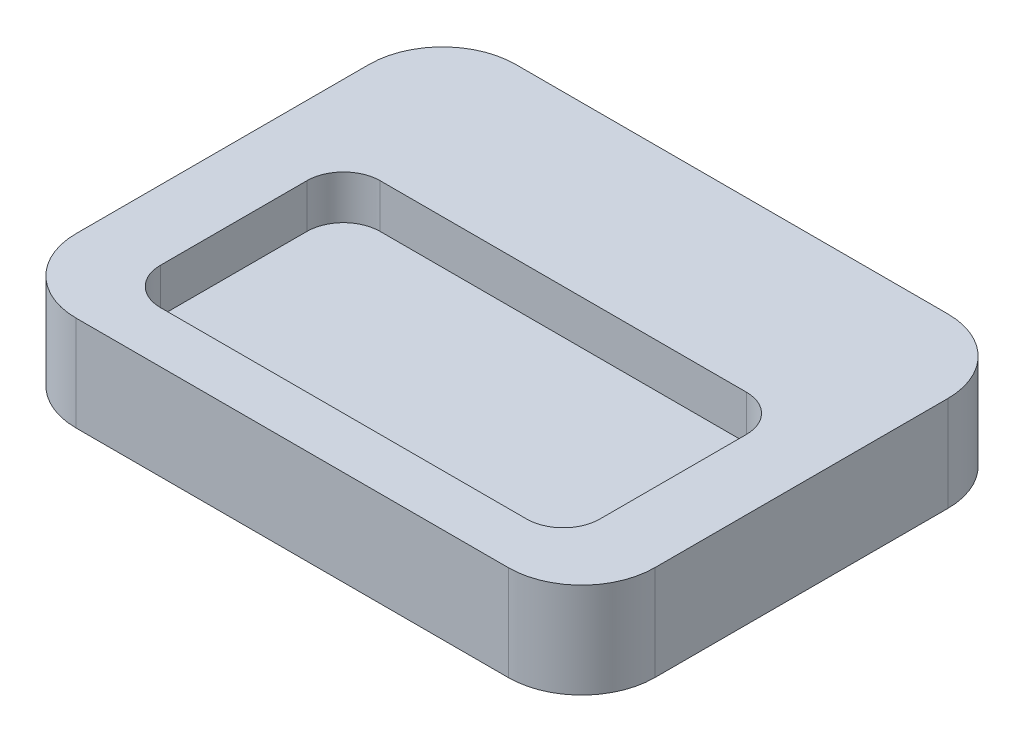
ISO-10303-21;
HEADER;
FILE_DESCRIPTION(('STEP AP214'),'2;1');
FILE_NAME('part.step','',(''),(''),'','','');
FILE_SCHEMA(('AUTOMOTIVE_DESIGN { 1 0 10303 214 1 1 1 1 }'));
ENDSEC;
DATA;
#1=APPLICATION_CONTEXT('core data for automotive mechanical design processes');
#2=APPLICATION_PROTOCOL_DEFINITION('international standard','automotive_design',2000,#1);
#3=PRODUCT_CONTEXT('',#1,'mechanical');
#4=PRODUCT('Part','Part','',(#3));
#5=PRODUCT_RELATED_PRODUCT_CATEGORY('part','',(#4));
#6=PRODUCT_DEFINITION_FORMATION('','',#4);
#7=PRODUCT_DEFINITION_CONTEXT('part definition',#1,'design');
#8=PRODUCT_DEFINITION('design','',#6,#7);
#9=PRODUCT_DEFINITION_SHAPE('','',#8);
#10=(LENGTH_UNIT() NAMED_UNIT(*) SI_UNIT(.MILLI.,.METRE.));
#11=(NAMED_UNIT(*) PLANE_ANGLE_UNIT() SI_UNIT($,.RADIAN.));
#12=(NAMED_UNIT(*) SI_UNIT($,.STERADIAN.) SOLID_ANGLE_UNIT());
#13=UNCERTAINTY_MEASURE_WITH_UNIT(LENGTH_MEASURE(1.E-05),#10,'distance_accuracy_value','');
#14=(GEOMETRIC_REPRESENTATION_CONTEXT(3) GLOBAL_UNCERTAINTY_ASSIGNED_CONTEXT((#13)) GLOBAL_UNIT_ASSIGNED_CONTEXT((#10,
#11,#12)) REPRESENTATION_CONTEXT('',''));
#15=CARTESIAN_POINT('',(0.,0.,0.));
#16=DIRECTION('',(0.,0.,1.));
#17=DIRECTION('',(1.,0.,0.));
#18=AXIS2_PLACEMENT_3D('',#15,#16,#17);
#19=CARTESIAN_POINT('',(0.,26.,-15.0580110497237));
#20=DIRECTION('',(0.,0.,-1.));
#21=DIRECTION('',(-1.,0.,0.));
#22=AXIS2_PLACEMENT_3D('',#19,#20,#21);
#23=PLANE('',#22);
#24=DIRECTION('',(0.,-1.,0.));
#25=VECTOR('',#24,1.);
#26=CARTESIAN_POINT('',(-26.3720073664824,26.,-15.0580110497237));
#27=LINE('',#26,#25);
#28=CARTESIAN_POINT('',(-26.3720073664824,13.,-15.0580110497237));
#29=VERTEX_POINT('',#28);
#30=CARTESIAN_POINT('',(-26.3720073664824,0.,-15.0580110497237));
#31=VERTEX_POINT('',#30);
#32=EDGE_CURVE('E542',#29,#31,#27,.T.);
#33=ORIENTED_EDGE('',*,*,#32,.F.);
#34=DIRECTION('',(1.,0.,0.));
#35=VECTOR('',#34,1.);
#36=CARTESIAN_POINT('',(0.,13.,-15.0580110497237));
#37=LINE('',#36,#35);
#38=CARTESIAN_POINT('',(32.6279926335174,13.,-15.0580110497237));
#39=VERTEX_POINT('',#38);
#40=EDGE_CURVE('E465',#29,#39,#37,.T.);
#41=ORIENTED_EDGE('',*,*,#40,.T.);
#42=DIRECTION('',(0.,-1.,0.));
#43=VECTOR('',#42,1.);
#44=CARTESIAN_POINT('',(32.6279926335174,26.,-15.0580110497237));
#45=LINE('',#44,#43);
#46=CARTESIAN_POINT('',(32.6279926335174,0.,-15.0580110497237));
#47=VERTEX_POINT('',#46);
#48=EDGE_CURVE('E544',#39,#47,#45,.T.);
#49=ORIENTED_EDGE('',*,*,#48,.T.);
#50=DIRECTION('',(1.,0.,0.));
#51=VECTOR('',#50,1.);
#52=CARTESIAN_POINT('',(0.,0.,-15.0580110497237));
#53=LINE('',#52,#51);
#54=EDGE_CURVE('E539',#31,#47,#53,.T.);
#55=ORIENTED_EDGE('',*,*,#54,.F.);
#56=EDGE_LOOP('',(#33,#41,#49,#55));
#57=FACE_BOUND('',#56,.T.);
#58=ADVANCED_FACE('F91',(#57),#23,.T.);
#59=CARTESIAN_POINT('',(32.6279926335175,26.,-5.0580110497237));
#60=DIRECTION('',(0.,-1.,0.));
#61=DIRECTION('',(0.,0.,-1.));
#62=AXIS2_PLACEMENT_3D('',#59,#60,#61);
#63=CYLINDRICAL_SURFACE('',#62,10.);
#64=CARTESIAN_POINT('',(32.6279926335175,13.,-5.0580110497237));
#65=DIRECTION('',(0.,1.,0.));
#66=DIRECTION('',(0.,0.,1.));
#67=AXIS2_PLACEMENT_3D('',#64,#65,#66);
#68=CIRCLE('',#67,10.);
#69=CARTESIAN_POINT('',(42.6279926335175,13.,-5.05801104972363));
#70=VERTEX_POINT('',#69);
#71=EDGE_CURVE('E463',#70,#39,#68,.T.);
#72=ORIENTED_EDGE('',*,*,#71,.F.);
#73=DIRECTION('',(0.,-1.,0.));
#74=VECTOR('',#73,1.);
#75=CARTESIAN_POINT('',(42.6279926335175,26.,-5.05801104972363));
#76=LINE('',#75,#74);
#77=CARTESIAN_POINT('',(42.6279926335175,0.,-5.05801104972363));
#78=VERTEX_POINT('',#77);
#79=EDGE_CURVE('E546',#70,#78,#76,.T.);
#80=ORIENTED_EDGE('',*,*,#79,.T.);
#81=CARTESIAN_POINT('',(32.6279926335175,0.,-5.0580110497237));
#82=DIRECTION('',(0.,1.,0.));
#83=DIRECTION('',(0.,0.,1.));
#84=AXIS2_PLACEMENT_3D('',#81,#82,#83);
#85=CIRCLE('',#84,10.);
#86=EDGE_CURVE('E536',#78,#47,#85,.T.);
#87=ORIENTED_EDGE('',*,*,#86,.T.);
#88=ORIENTED_EDGE('',*,*,#48,.F.);
#89=EDGE_LOOP('',(#72,#80,#87,#88));
#90=FACE_BOUND('',#89,.T.);
#91=ADVANCED_FACE('F586',(#90),#63,.T.);
#92=CARTESIAN_POINT('',(42.6279926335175,26.,0.));
#93=DIRECTION('',(1.,0.,0.));
#94=DIRECTION('',(0.,0.,-1.));
#95=AXIS2_PLACEMENT_3D('',#92,#93,#94);
#96=PLANE('',#95);
#97=ORIENTED_EDGE('',*,*,#79,.F.);
#98=DIRECTION('',(0.,0.,1.));
#99=VECTOR('',#98,1.);
#100=CARTESIAN_POINT('',(42.6279926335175,13.,0.));
#101=LINE('',#100,#99);
#102=CARTESIAN_POINT('',(42.6279926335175,13.,34.9419889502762));
#103=VERTEX_POINT('',#102);
#104=EDGE_CURVE('E460',#70,#103,#101,.T.);
#105=ORIENTED_EDGE('',*,*,#104,.T.);
#106=DIRECTION('',(0.,-1.,0.));
#107=VECTOR('',#106,1.);
#108=CARTESIAN_POINT('',(42.6279926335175,26.,34.9419889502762));
#109=LINE('',#108,#107);
#110=CARTESIAN_POINT('',(42.6279926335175,0.,34.9419889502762));
#111=VERTEX_POINT('',#110);
#112=EDGE_CURVE('E548',#103,#111,#109,.T.);
#113=ORIENTED_EDGE('',*,*,#112,.T.);
#114=DIRECTION('',(0.,0.,1.));
#115=VECTOR('',#114,1.);
#116=CARTESIAN_POINT('',(42.6279926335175,0.,0.));
#117=LINE('',#116,#115);
#118=EDGE_CURVE('E533',#78,#111,#117,.T.);
#119=ORIENTED_EDGE('',*,*,#118,.F.);
#120=EDGE_LOOP('',(#97,#105,#113,#119));
#121=FACE_BOUND('',#120,.T.);
#122=ADVANCED_FACE('F582',(#121),#96,.T.);
#123=CARTESIAN_POINT('',(32.6279926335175,26.,34.9419889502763));
#124=DIRECTION('',(0.,-1.,0.));
#125=DIRECTION('',(0.,0.,-1.));
#126=AXIS2_PLACEMENT_3D('',#123,#124,#125);
#127=CYLINDRICAL_SURFACE('',#126,10.);
#128=CARTESIAN_POINT('',(32.6279926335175,13.,34.9419889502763));
#129=DIRECTION('',(0.,1.,0.));
#130=DIRECTION('',(0.,0.,1.));
#131=AXIS2_PLACEMENT_3D('',#128,#129,#130);
#132=CIRCLE('',#131,10.);
#133=CARTESIAN_POINT('',(32.6279926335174,13.,44.9419889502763));
#134=VERTEX_POINT('',#133);
#135=EDGE_CURVE('E458',#134,#103,#132,.T.);
#136=ORIENTED_EDGE('',*,*,#135,.F.);
#137=DIRECTION('',(0.,-1.,0.));
#138=VECTOR('',#137,1.);
#139=CARTESIAN_POINT('',(32.6279926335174,26.,44.9419889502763));
#140=LINE('',#139,#138);
#141=CARTESIAN_POINT('',(32.6279926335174,0.,44.9419889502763));
#142=VERTEX_POINT('',#141);
#143=EDGE_CURVE('E550',#134,#142,#140,.T.);
#144=ORIENTED_EDGE('',*,*,#143,.T.);
#145=CARTESIAN_POINT('',(32.6279926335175,0.,34.9419889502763));
#146=DIRECTION('',(0.,1.,0.));
#147=DIRECTION('',(0.,0.,1.));
#148=AXIS2_PLACEMENT_3D('',#145,#146,#147);
#149=CIRCLE('',#148,10.);
#150=EDGE_CURVE('E530',#142,#111,#149,.T.);
#151=ORIENTED_EDGE('',*,*,#150,.T.);
#152=ORIENTED_EDGE('',*,*,#112,.F.);
#153=EDGE_LOOP('',(#136,#144,#151,#152));
#154=FACE_BOUND('',#153,.T.);
#155=ADVANCED_FACE('F578',(#154),#127,.T.);
#156=CARTESIAN_POINT('',(0.,26.,44.9419889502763));
#157=DIRECTION('',(0.,0.,-1.));
#158=DIRECTION('',(-1.,0.,0.));
#159=AXIS2_PLACEMENT_3D('',#156,#157,#158);
#160=PLANE('',#159);
#161=DIRECTION('',(1.,0.,0.));
#162=VECTOR('',#161,1.);
#163=CARTESIAN_POINT('',(0.,13.,44.9419889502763));
#164=LINE('',#163,#162);
#165=CARTESIAN_POINT('',(-26.3720073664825,13.,44.9419889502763));
#166=VERTEX_POINT('',#165);
#167=EDGE_CURVE('E456',#166,#134,#164,.T.);
#168=ORIENTED_EDGE('',*,*,#167,.F.);
#169=DIRECTION('',(0.,-1.,0.));
#170=VECTOR('',#169,1.);
#171=CARTESIAN_POINT('',(-26.3720073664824,26.,44.9419889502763));
#172=LINE('',#171,#170);
#173=CARTESIAN_POINT('',(-26.3720073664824,0.,44.9419889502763));
#174=VERTEX_POINT('',#173);
#175=EDGE_CURVE('E552',#166,#174,#172,.T.);
#176=ORIENTED_EDGE('',*,*,#175,.T.);
#177=DIRECTION('',(1.,0.,0.));
#178=VECTOR('',#177,1.);
#179=CARTESIAN_POINT('',(0.,0.,44.9419889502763));
#180=LINE('',#179,#178);
#181=EDGE_CURVE('E527',#174,#142,#180,.T.);
#182=ORIENTED_EDGE('',*,*,#181,.T.);
#183=ORIENTED_EDGE('',*,*,#143,.F.);
#184=EDGE_LOOP('',(#168,#176,#182,#183));
#185=FACE_BOUND('',#184,.T.);
#186=ADVANCED_FACE('F572',(#185),#160,.F.);
#187=CARTESIAN_POINT('',(-26.3720073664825,26.,34.9419889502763));
#188=DIRECTION('',(0.,-1.,0.));
#189=DIRECTION('',(0.,0.,-1.));
#190=AXIS2_PLACEMENT_3D('',#187,#188,#189);
#191=CYLINDRICAL_SURFACE('',#190,10.);
#192=CARTESIAN_POINT('',(-26.3720073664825,13.,34.9419889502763));
#193=DIRECTION('',(0.,1.,0.));
#194=DIRECTION('',(0.,0.,1.));
#195=AXIS2_PLACEMENT_3D('',#192,#193,#194);
#196=CIRCLE('',#195,10.);
#197=CARTESIAN_POINT('',(-36.3720073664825,13.,34.9419889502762));
#198=VERTEX_POINT('',#197);
#199=EDGE_CURVE('E454',#198,#166,#196,.T.);
#200=ORIENTED_EDGE('',*,*,#199,.F.);
#201=DIRECTION('',(0.,-1.,0.));
#202=VECTOR('',#201,1.);
#203=CARTESIAN_POINT('',(-36.3720073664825,26.,34.9419889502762));
#204=LINE('',#203,#202);
#205=CARTESIAN_POINT('',(-36.3720073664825,0.,34.9419889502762));
#206=VERTEX_POINT('',#205);
#207=EDGE_CURVE('E99',#198,#206,#204,.T.);
#208=ORIENTED_EDGE('',*,*,#207,.T.);
#209=CARTESIAN_POINT('',(-26.3720073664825,0.,34.9419889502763));
#210=DIRECTION('',(0.,1.,0.));
#211=DIRECTION('',(0.,0.,1.));
#212=AXIS2_PLACEMENT_3D('',#209,#210,#211);
#213=CIRCLE('',#212,10.);
#214=EDGE_CURVE('E524',#206,#174,#213,.T.);
#215=ORIENTED_EDGE('',*,*,#214,.T.);
#216=ORIENTED_EDGE('',*,*,#175,.F.);
#217=EDGE_LOOP('',(#200,#208,#215,#216));
#218=FACE_BOUND('',#217,.T.);
#219=ADVANCED_FACE('F556',(#218),#191,.T.);
#220=CARTESIAN_POINT('',(-36.3720073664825,26.,0.));
#221=DIRECTION('',(1.,0.,0.));
#222=DIRECTION('',(0.,0.,-1.));
#223=AXIS2_PLACEMENT_3D('',#220,#221,#222);
#224=PLANE('',#223);
#225=DIRECTION('',(0.,0.,1.));
#226=VECTOR('',#225,1.);
#227=CARTESIAN_POINT('',(-36.3720073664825,13.,0.));
#228=LINE('',#227,#226);
#229=CARTESIAN_POINT('',(-36.3720073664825,13.,-5.05801104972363));
#230=VERTEX_POINT('',#229);
#231=EDGE_CURVE('E452',#230,#198,#228,.T.);
#232=ORIENTED_EDGE('',*,*,#231,.F.);
#233=DIRECTION('',(0.,-1.,0.));
#234=VECTOR('',#233,1.);
#235=CARTESIAN_POINT('',(-36.3720073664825,26.,-5.05801104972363));
#236=LINE('',#235,#234);
#237=CARTESIAN_POINT('',(-36.3720073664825,0.,-5.05801104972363));
#238=VERTEX_POINT('',#237);
#239=EDGE_CURVE('E12',#230,#238,#236,.T.);
#240=ORIENTED_EDGE('',*,*,#239,.T.);
#241=DIRECTION('',(0.,0.,1.));
#242=VECTOR('',#241,1.);
#243=CARTESIAN_POINT('',(-36.3720073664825,0.,0.));
#244=LINE('',#243,#242);
#245=EDGE_CURVE('E521',#238,#206,#244,.T.);
#246=ORIENTED_EDGE('',*,*,#245,.T.);
#247=ORIENTED_EDGE('',*,*,#207,.F.);
#248=EDGE_LOOP('',(#232,#240,#246,#247));
#249=FACE_BOUND('',#248,.T.);
#250=ADVANCED_FACE('F563',(#249),#224,.F.);
#251=CARTESIAN_POINT('',(-26.3720073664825,26.,-5.0580110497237));
#252=DIRECTION('',(0.,-1.,0.));
#253=DIRECTION('',(0.,0.,-1.));
#254=AXIS2_PLACEMENT_3D('',#251,#252,#253);
#255=CYLINDRICAL_SURFACE('',#254,10.);
#256=ORIENTED_EDGE('',*,*,#239,.F.);
#257=CARTESIAN_POINT('',(-26.3720073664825,13.,-5.0580110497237));
#258=DIRECTION('',(0.,1.,0.));
#259=DIRECTION('',(0.,0.,1.));
#260=AXIS2_PLACEMENT_3D('',#257,#258,#259);
#261=CIRCLE('',#260,10.);
#262=EDGE_CURVE('E449',#230,#29,#261,.F.);
#263=ORIENTED_EDGE('',*,*,#262,.T.);
#264=ORIENTED_EDGE('',*,*,#32,.T.);
#265=CARTESIAN_POINT('',(-26.3720073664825,0.,-5.0580110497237));
#266=DIRECTION('',(0.,1.,0.));
#267=DIRECTION('',(0.,0.,1.));
#268=AXIS2_PLACEMENT_3D('',#265,#266,#267);
#269=CIRCLE('',#268,10.);
#270=EDGE_CURVE('E498',#238,#31,#269,.F.);
#271=ORIENTED_EDGE('',*,*,#270,.F.);
#272=EDGE_LOOP('',(#256,#263,#264,#271));
#273=FACE_BOUND('',#272,.T.);
#274=ADVANCED_FACE('F93',(#273),#255,.T.);
#275=CARTESIAN_POINT('',(0.,0.,0.));
#276=DIRECTION('',(0.,1.,0.));
#277=DIRECTION('',(0.,0.,1.));
#278=AXIS2_PLACEMENT_3D('',#275,#276,#277);
#279=PLANE('',#278);
#280=DIRECTION('',(-1.,0.,0.));
#281=VECTOR('',#280,1.);
#282=CARTESIAN_POINT('',(0.127992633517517,0.,39.9419889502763));
#283=LINE('',#282,#281);
#284=CARTESIAN_POINT('',(6.12799263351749,0.,39.9419889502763));
#285=VERTEX_POINT('',#284);
#286=CARTESIAN_POINT('',(0.127992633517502,0.,39.9419889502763));
#287=VERTEX_POINT('',#286);
#288=EDGE_CURVE('E340',#285,#287,#283,.T.);
#289=ORIENTED_EDGE('',*,*,#288,.F.);
#290=CARTESIAN_POINT('',(6.1279926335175,0.,37.9419889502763));
#291=DIRECTION('',(0.,-1.,0.));
#292=DIRECTION('',(0.,0.,-1.));
#293=AXIS2_PLACEMENT_3D('',#290,#291,#292);
#294=CIRCLE('',#293,2.);
#295=CARTESIAN_POINT('',(8.1279926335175,0.,37.9419889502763));
#296=VERTEX_POINT('',#295);
#297=EDGE_CURVE('E106',#296,#285,#294,.T.);
#298=ORIENTED_EDGE('',*,*,#297,.F.);
#299=DIRECTION('',(0.,0.,1.));
#300=VECTOR('',#299,1.);
#301=CARTESIAN_POINT('',(8.1279926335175,0.,31.9419889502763));
#302=LINE('',#301,#300);
#303=CARTESIAN_POINT('',(8.1279926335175,0.,31.9419889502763));
#304=VERTEX_POINT('',#303);
#305=EDGE_CURVE('E320',#304,#296,#302,.T.);
#306=ORIENTED_EDGE('',*,*,#305,.F.);
#307=CARTESIAN_POINT('',(6.1279926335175,0.,31.9419889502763));
#308=DIRECTION('',(0.,-1.,0.));
#309=DIRECTION('',(0.,0.,-1.));
#310=AXIS2_PLACEMENT_3D('',#307,#308,#309);
#311=CIRCLE('',#310,2.);
#312=CARTESIAN_POINT('',(6.12799263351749,0.,29.9419889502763));
#313=VERTEX_POINT('',#312);
#314=EDGE_CURVE('E323',#313,#304,#311,.T.);
#315=ORIENTED_EDGE('',*,*,#314,.F.);
#316=DIRECTION('',(1.,0.,0.));
#317=VECTOR('',#316,1.);
#318=CARTESIAN_POINT('',(0.127992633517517,0.,29.9419889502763));
#319=LINE('',#318,#317);
#320=CARTESIAN_POINT('',(0.127992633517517,0.,29.9419889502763));
#321=VERTEX_POINT('',#320);
#322=EDGE_CURVE('E351',#321,#313,#319,.T.);
#323=ORIENTED_EDGE('',*,*,#322,.F.);
#324=CARTESIAN_POINT('',(0.127992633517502,0.,31.9419889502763));
#325=DIRECTION('',(0.,-1.,0.));
#326=DIRECTION('',(0.,0.,-1.));
#327=AXIS2_PLACEMENT_3D('',#324,#325,#326);
#328=CIRCLE('',#327,2.);
#329=CARTESIAN_POINT('',(-1.8720073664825,0.,31.9419889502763));
#330=VERTEX_POINT('',#329);
#331=EDGE_CURVE('E348',#330,#321,#328,.T.);
#332=ORIENTED_EDGE('',*,*,#331,.F.);
#333=DIRECTION('',(0.,0.,-1.));
#334=VECTOR('',#333,1.);
#335=CARTESIAN_POINT('',(-1.8720073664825,0.,31.9419889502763));
#336=LINE('',#335,#334);
#337=CARTESIAN_POINT('',(-1.8720073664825,0.,37.9419889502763));
#338=VERTEX_POINT('',#337);
#339=EDGE_CURVE('E345',#338,#330,#336,.T.);
#340=ORIENTED_EDGE('',*,*,#339,.F.);
#341=CARTESIAN_POINT('',(0.127992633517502,0.,37.9419889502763));
#342=DIRECTION('',(0.,-1.,0.));
#343=DIRECTION('',(0.,0.,1.));
#344=AXIS2_PLACEMENT_3D('',#341,#342,#343);
#345=CIRCLE('',#344,2.);
#346=EDGE_CURVE('E342',#287,#338,#345,.T.);
#347=ORIENTED_EDGE('',*,*,#346,.F.);
#348=EDGE_LOOP('',(#289,#298,#306,#315,#323,#332,#340,#347));
#349=FACE_BOUND('',#348,.T.);
#350=DIRECTION('',(0.,0.,1.));
#351=VECTOR('',#350,1.);
#352=CARTESIAN_POINT('',(30.1279926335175,0.,-6.3080110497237));
#353=LINE('',#352,#351);
#354=CARTESIAN_POINT('',(30.1279926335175,0.,-6.3080110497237));
#355=VERTEX_POINT('',#354);
#356=CARTESIAN_POINT('',(30.1279926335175,0.,16.1919889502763));
#357=VERTEX_POINT('',#356);
#358=EDGE_CURVE('E396',#355,#357,#353,.T.);
#359=ORIENTED_EDGE('',*,*,#358,.F.);
#360=CARTESIAN_POINT('',(28.1279926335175,0.,-6.3080110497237));
#361=DIRECTION('',(0.,-1.,0.));
#362=DIRECTION('',(0.,0.,1.));
#363=AXIS2_PLACEMENT_3D('',#360,#361,#362);
#364=CIRCLE('',#363,2.);
#365=CARTESIAN_POINT('',(28.1279926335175,0.,-8.3080110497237));
#366=VERTEX_POINT('',#365);
#367=EDGE_CURVE('E114',#366,#355,#364,.T.);
#368=ORIENTED_EDGE('',*,*,#367,.F.);
#369=DIRECTION('',(1.,0.,0.));
#370=VECTOR('',#369,1.);
#371=CARTESIAN_POINT('',(-21.8720073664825,0.,-8.3080110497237));
#372=LINE('',#371,#370);
#373=CARTESIAN_POINT('',(-21.8720073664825,0.,-8.30801104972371));
#374=VERTEX_POINT('',#373);
#375=EDGE_CURVE('E373',#374,#366,#372,.T.);
#376=ORIENTED_EDGE('',*,*,#375,.F.);
#377=CARTESIAN_POINT('',(-21.8720073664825,0.,-6.3080110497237));
#378=DIRECTION('',(0.,-1.,0.));
#379=DIRECTION('',(0.,0.,1.));
#380=AXIS2_PLACEMENT_3D('',#377,#378,#379);
#381=CIRCLE('',#380,2.);
#382=CARTESIAN_POINT('',(-23.8720073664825,0.,-6.3080110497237));
#383=VERTEX_POINT('',#382);
#384=EDGE_CURVE('E411',#383,#374,#381,.T.);
#385=ORIENTED_EDGE('',*,*,#384,.F.);
#386=DIRECTION('',(0.,0.,-1.));
#387=VECTOR('',#386,1.);
#388=CARTESIAN_POINT('',(-23.8720073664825,0.,-6.3080110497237));
#389=LINE('',#388,#387);
#390=CARTESIAN_POINT('',(-23.8720073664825,0.,16.1919889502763));
#391=VERTEX_POINT('',#390);
#392=EDGE_CURVE('E408',#391,#383,#389,.T.);
#393=ORIENTED_EDGE('',*,*,#392,.F.);
#394=CARTESIAN_POINT('',(-21.8720073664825,0.,16.1919889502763));
#395=DIRECTION('',(0.,-1.,0.));
#396=DIRECTION('',(0.,0.,-1.));
#397=AXIS2_PLACEMENT_3D('',#394,#395,#396);
#398=CIRCLE('',#397,2.);
#399=CARTESIAN_POINT('',(-21.8720073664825,0.,18.1919889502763));
#400=VERTEX_POINT('',#399);
#401=EDGE_CURVE('E405',#400,#391,#398,.T.);
#402=ORIENTED_EDGE('',*,*,#401,.F.);
#403=DIRECTION('',(-1.,0.,0.));
#404=VECTOR('',#403,1.);
#405=CARTESIAN_POINT('',(-21.8720073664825,0.,18.1919889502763));
#406=LINE('',#405,#404);
#407=CARTESIAN_POINT('',(28.1279926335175,0.,18.1919889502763));
#408=VERTEX_POINT('',#407);
#409=EDGE_CURVE('E402',#408,#400,#406,.T.);
#410=ORIENTED_EDGE('',*,*,#409,.F.);
#411=CARTESIAN_POINT('',(28.1279926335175,0.,16.1919889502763));
#412=DIRECTION('',(0.,-1.,0.));
#413=DIRECTION('',(0.,0.,1.));
#414=AXIS2_PLACEMENT_3D('',#411,#412,#413);
#415=CIRCLE('',#414,2.);
#416=EDGE_CURVE('E399',#357,#408,#415,.T.);
#417=ORIENTED_EDGE('',*,*,#416,.F.);
#418=EDGE_LOOP('',(#359,#368,#376,#385,#393,#402,#410,#417));
#419=FACE_BOUND('',#418,.T.);
#420=ORIENTED_EDGE('',*,*,#270,.T.);
#421=ORIENTED_EDGE('',*,*,#54,.T.);
#422=ORIENTED_EDGE('',*,*,#86,.F.);
#423=ORIENTED_EDGE('',*,*,#118,.T.);
#424=ORIENTED_EDGE('',*,*,#150,.F.);
#425=ORIENTED_EDGE('',*,*,#181,.F.);
#426=ORIENTED_EDGE('',*,*,#214,.F.);
#427=ORIENTED_EDGE('',*,*,#245,.F.);
#428=EDGE_LOOP('',(#420,#421,#422,#423,#424,#425,#426,#427));
#429=FACE_BOUND('',#428,.T.);
#430=ADVANCED_FACE('F567',(#349,#419,#429),#279,.F.);
#431=CARTESIAN_POINT('',(0.,7.,0.));
#432=DIRECTION('',(0.,1.,0.));
#433=DIRECTION('',(0.,0.,1.));
#434=AXIS2_PLACEMENT_3D('',#431,#432,#433);
#435=PLANE('',#434);
#436=DIRECTION('',(-1.,0.,0.));
#437=VECTOR('',#436,1.);
#438=CARTESIAN_POINT('',(0.,7.,37.9419889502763));
#439=LINE('',#438,#437);
#440=CARTESIAN_POINT('',(28.1279926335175,7.,37.9419889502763));
#441=VERTEX_POINT('',#440);
#442=CARTESIAN_POINT('',(-21.8720073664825,7.,37.9419889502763));
#443=VERTEX_POINT('',#442);
#444=EDGE_CURVE('E468',#441,#443,#439,.T.);
#445=ORIENTED_EDGE('',*,*,#444,.F.);
#446=CARTESIAN_POINT('',(28.1279926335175,7.,32.9419889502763));
#447=DIRECTION('',(0.,1.,0.));
#448=DIRECTION('',(0.,0.,1.));
#449=AXIS2_PLACEMENT_3D('',#446,#447,#448);
#450=CIRCLE('',#449,5.);
#451=CARTESIAN_POINT('',(33.1279926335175,7.,32.9419889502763));
#452=VERTEX_POINT('',#451);
#453=EDGE_CURVE('E471',#441,#452,#450,.T.);
#454=ORIENTED_EDGE('',*,*,#453,.T.);
#455=DIRECTION('',(0.,0.,-1.));
#456=VECTOR('',#455,1.);
#457=CARTESIAN_POINT('',(33.1279926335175,7.,0.));
#458=LINE('',#457,#456);
#459=CARTESIAN_POINT('',(33.1279926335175,7.,12.9419889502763));
#460=VERTEX_POINT('',#459);
#461=EDGE_CURVE('E474',#452,#460,#458,.T.);
#462=ORIENTED_EDGE('',*,*,#461,.T.);
#463=CARTESIAN_POINT('',(28.1279926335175,7.,12.9419889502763));
#464=DIRECTION('',(0.,1.,0.));
#465=DIRECTION('',(0.,0.,1.));
#466=AXIS2_PLACEMENT_3D('',#463,#464,#465);
#467=CIRCLE('',#466,5.);
#468=CARTESIAN_POINT('',(28.1279926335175,7.,7.9419889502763));
#469=VERTEX_POINT('',#468);
#470=EDGE_CURVE('E477',#460,#469,#467,.T.);
#471=ORIENTED_EDGE('',*,*,#470,.T.);
#472=DIRECTION('',(-1.,0.,0.));
#473=VECTOR('',#472,1.);
#474=CARTESIAN_POINT('',(0.,7.,7.9419889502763));
#475=LINE('',#474,#473);
#476=CARTESIAN_POINT('',(-21.8720073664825,7.,7.94198895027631));
#477=VERTEX_POINT('',#476);
#478=EDGE_CURVE('E480',#469,#477,#475,.T.);
#479=ORIENTED_EDGE('',*,*,#478,.T.);
#480=CARTESIAN_POINT('',(-21.8720073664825,7.,12.9419889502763));
#481=DIRECTION('',(0.,1.,0.));
#482=DIRECTION('',(0.,0.,1.));
#483=AXIS2_PLACEMENT_3D('',#480,#481,#482);
#484=CIRCLE('',#483,5.);
#485=CARTESIAN_POINT('',(-26.8720073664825,7.,12.9419889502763));
#486=VERTEX_POINT('',#485);
#487=EDGE_CURVE('E483',#486,#477,#484,.F.);
#488=ORIENTED_EDGE('',*,*,#487,.F.);
#489=DIRECTION('',(0.,0.,-1.));
#490=VECTOR('',#489,1.);
#491=CARTESIAN_POINT('',(-26.8720073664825,7.,0.));
#492=LINE('',#491,#490);
#493=CARTESIAN_POINT('',(-26.8720073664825,7.,32.9419889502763));
#494=VERTEX_POINT('',#493);
#495=EDGE_CURVE('E486',#494,#486,#492,.T.);
#496=ORIENTED_EDGE('',*,*,#495,.F.);
#497=CARTESIAN_POINT('',(-21.8720073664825,7.,32.9419889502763));
#498=DIRECTION('',(0.,1.,0.));
#499=DIRECTION('',(0.,0.,1.));
#500=AXIS2_PLACEMENT_3D('',#497,#498,#499);
#501=CIRCLE('',#500,5.);
#502=EDGE_CURVE('E489',#443,#494,#501,.F.);
#503=ORIENTED_EDGE('',*,*,#502,.F.);
#504=EDGE_LOOP('',(#445,#454,#462,#471,#479,#488,#496,#503));
#505=FACE_BOUND('',#504,.T.);
#506=ADVANCED_FACE('F597',(#505),#435,.T.);
#507=CARTESIAN_POINT('',(0.,13.,0.));
#508=DIRECTION('',(0.,1.,0.));
#509=DIRECTION('',(0.,0.,1.));
#510=AXIS2_PLACEMENT_3D('',#507,#508,#509);
#511=PLANE('',#510);
#512=DIRECTION('',(-1.,0.,0.));
#513=VECTOR('',#512,1.);
#514=CARTESIAN_POINT('',(0.,13.,7.9419889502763));
#515=LINE('',#514,#513);
#516=CARTESIAN_POINT('',(28.1279926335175,13.,7.9419889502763));
#517=VERTEX_POINT('',#516);
#518=CARTESIAN_POINT('',(-21.8720073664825,13.,7.94198895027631));
#519=VERTEX_POINT('',#518);
#520=EDGE_CURVE('E492',#517,#519,#515,.T.);
#521=ORIENTED_EDGE('',*,*,#520,.F.);
#522=CARTESIAN_POINT('',(28.1279926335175,13.,12.9419889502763));
#523=DIRECTION('',(0.,1.,0.));
#524=DIRECTION('',(0.,0.,1.));
#525=AXIS2_PLACEMENT_3D('',#522,#523,#524);
#526=CIRCLE('',#525,5.);
#527=CARTESIAN_POINT('',(33.1279926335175,13.,12.9419889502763));
#528=VERTEX_POINT('',#527);
#529=EDGE_CURVE('E435',#517,#528,#526,.F.);
#530=ORIENTED_EDGE('',*,*,#529,.T.);
#531=DIRECTION('',(0.,0.,1.));
#532=VECTOR('',#531,1.);
#533=CARTESIAN_POINT('',(33.1279926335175,13.,0.));
#534=LINE('',#533,#532);
#535=CARTESIAN_POINT('',(33.1279926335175,13.,32.9419889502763));
#536=VERTEX_POINT('',#535);
#537=EDGE_CURVE('E433',#528,#536,#534,.T.);
#538=ORIENTED_EDGE('',*,*,#537,.T.);
#539=CARTESIAN_POINT('',(28.1279926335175,13.,32.9419889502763));
#540=DIRECTION('',(0.,1.,0.));
#541=DIRECTION('',(0.,0.,1.));
#542=AXIS2_PLACEMENT_3D('',#539,#540,#541);
#543=CIRCLE('',#542,5.);
#544=CARTESIAN_POINT('',(28.1279926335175,13.,37.9419889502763));
#545=VERTEX_POINT('',#544);
#546=EDGE_CURVE('E418',#536,#545,#543,.F.);
#547=ORIENTED_EDGE('',*,*,#546,.T.);
#548=DIRECTION('',(1.,0.,0.));
#549=VECTOR('',#548,1.);
#550=CARTESIAN_POINT('',(0.,13.,37.9419889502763));
#551=LINE('',#550,#549);
#552=CARTESIAN_POINT('',(-21.8720073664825,13.,37.9419889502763));
#553=VERTEX_POINT('',#552);
#554=EDGE_CURVE('E437',#553,#545,#551,.T.);
#555=ORIENTED_EDGE('',*,*,#554,.F.);
#556=CARTESIAN_POINT('',(-21.8720073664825,13.,32.9419889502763));
#557=DIRECTION('',(0.,1.,0.));
#558=DIRECTION('',(0.,0.,1.));
#559=AXIS2_PLACEMENT_3D('',#556,#557,#558);
#560=CIRCLE('',#559,5.);
#561=CARTESIAN_POINT('',(-26.8720073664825,13.,32.9419889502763));
#562=VERTEX_POINT('',#561);
#563=EDGE_CURVE('E440',#562,#553,#560,.T.);
#564=ORIENTED_EDGE('',*,*,#563,.F.);
#565=DIRECTION('',(0.,0.,1.));
#566=VECTOR('',#565,1.);
#567=CARTESIAN_POINT('',(-26.8720073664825,13.,0.));
#568=LINE('',#567,#566);
#569=CARTESIAN_POINT('',(-26.8720073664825,13.,12.9419889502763));
#570=VERTEX_POINT('',#569);
#571=EDGE_CURVE('E443',#570,#562,#568,.T.);
#572=ORIENTED_EDGE('',*,*,#571,.F.);
#573=CARTESIAN_POINT('',(-21.8720073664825,13.,12.9419889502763));
#574=DIRECTION('',(0.,1.,0.));
#575=DIRECTION('',(0.,0.,1.));
#576=AXIS2_PLACEMENT_3D('',#573,#574,#575);
#577=CIRCLE('',#576,5.);
#578=EDGE_CURVE('E446',#519,#570,#577,.T.);
#579=ORIENTED_EDGE('',*,*,#578,.F.);
#580=EDGE_LOOP('',(#521,#530,#538,#547,#555,#564,#572,#579));
#581=FACE_BOUND('',#580,.T.);
#582=ORIENTED_EDGE('',*,*,#262,.F.);
#583=ORIENTED_EDGE('',*,*,#231,.T.);
#584=ORIENTED_EDGE('',*,*,#199,.T.);
#585=ORIENTED_EDGE('',*,*,#167,.T.);
#586=ORIENTED_EDGE('',*,*,#135,.T.);
#587=ORIENTED_EDGE('',*,*,#104,.F.);
#588=ORIENTED_EDGE('',*,*,#71,.T.);
#589=ORIENTED_EDGE('',*,*,#40,.F.);
#590=EDGE_LOOP('',(#582,#583,#584,#585,#586,#587,#588,#589));
#591=FACE_BOUND('',#590,.T.);
#592=ADVANCED_FACE('F575',(#581,#591),#511,.T.);
#593=CARTESIAN_POINT('',(28.1279926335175,11.,32.9419889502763));
#594=DIRECTION('',(0.,1.,0.));
#595=DIRECTION('',(0.,0.,1.));
#596=AXIS2_PLACEMENT_3D('',#593,#594,#595);
#597=CYLINDRICAL_SURFACE('',#596,5.);
#598=ORIENTED_EDGE('',*,*,#546,.F.);
#599=DIRECTION('',(0.,1.,0.));
#600=VECTOR('',#599,1.);
#601=CARTESIAN_POINT('',(33.1279926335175,11.,32.9419889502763));
#602=LINE('',#601,#600);
#603=EDGE_CURVE('E514',#452,#536,#602,.T.);
#604=ORIENTED_EDGE('',*,*,#603,.F.);
#605=ORIENTED_EDGE('',*,*,#453,.F.);
#606=DIRECTION('',(0.,1.,0.));
#607=VECTOR('',#606,1.);
#608=CARTESIAN_POINT('',(28.1279926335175,11.,37.9419889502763));
#609=LINE('',#608,#607);
#610=EDGE_CURVE('E494',#441,#545,#609,.T.);
#611=ORIENTED_EDGE('',*,*,#610,.T.);
#612=EDGE_LOOP('',(#598,#604,#605,#611));
#613=FACE_BOUND('',#612,.T.);
#614=ADVANCED_FACE('F637',(#613),#597,.F.);
#615=CARTESIAN_POINT('',(33.1279926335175,11.,0.));
#616=DIRECTION('',(1.,0.,0.));
#617=DIRECTION('',(0.,0.,-1.));
#618=AXIS2_PLACEMENT_3D('',#615,#616,#617);
#619=PLANE('',#618);
#620=ORIENTED_EDGE('',*,*,#537,.F.);
#621=DIRECTION('',(0.,1.,0.));
#622=VECTOR('',#621,1.);
#623=CARTESIAN_POINT('',(33.1279926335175,11.,12.9419889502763));
#624=LINE('',#623,#622);
#625=EDGE_CURVE('E511',#460,#528,#624,.T.);
#626=ORIENTED_EDGE('',*,*,#625,.F.);
#627=ORIENTED_EDGE('',*,*,#461,.F.);
#628=ORIENTED_EDGE('',*,*,#603,.T.);
#629=EDGE_LOOP('',(#620,#626,#627,#628));
#630=FACE_BOUND('',#629,.T.);
#631=ADVANCED_FACE('F651',(#630),#619,.F.);
#632=CARTESIAN_POINT('',(28.1279926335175,11.,12.9419889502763));
#633=DIRECTION('',(0.,1.,0.));
#634=DIRECTION('',(0.,0.,1.));
#635=AXIS2_PLACEMENT_3D('',#632,#633,#634);
#636=CYLINDRICAL_SURFACE('',#635,5.);
#637=ORIENTED_EDGE('',*,*,#529,.F.);
#638=DIRECTION('',(0.,1.,0.));
#639=VECTOR('',#638,1.);
#640=CARTESIAN_POINT('',(28.1279926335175,11.,7.9419889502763));
#641=LINE('',#640,#639);
#642=EDGE_CURVE('E508',#469,#517,#641,.T.);
#643=ORIENTED_EDGE('',*,*,#642,.F.);
#644=ORIENTED_EDGE('',*,*,#470,.F.);
#645=ORIENTED_EDGE('',*,*,#625,.T.);
#646=EDGE_LOOP('',(#637,#643,#644,#645));
#647=FACE_BOUND('',#646,.T.);
#648=ADVANCED_FACE('F662',(#647),#636,.F.);
#649=CARTESIAN_POINT('',(0.,11.,7.9419889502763));
#650=DIRECTION('',(0.,0.,-1.));
#651=DIRECTION('',(-1.,0.,0.));
#652=AXIS2_PLACEMENT_3D('',#649,#650,#651);
#653=PLANE('',#652);
#654=ORIENTED_EDGE('',*,*,#520,.T.);
#655=DIRECTION('',(0.,1.,0.));
#656=VECTOR('',#655,1.);
#657=CARTESIAN_POINT('',(-21.8720073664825,11.,7.94198895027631));
#658=LINE('',#657,#656);
#659=EDGE_CURVE('E505',#477,#519,#658,.T.);
#660=ORIENTED_EDGE('',*,*,#659,.F.);
#661=ORIENTED_EDGE('',*,*,#478,.F.);
#662=ORIENTED_EDGE('',*,*,#642,.T.);
#663=EDGE_LOOP('',(#654,#660,#661,#662));
#664=FACE_BOUND('',#663,.T.);
#665=ADVANCED_FACE('F672',(#664),#653,.F.);
#666=CARTESIAN_POINT('',(-21.8720073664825,11.,12.9419889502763));
#667=DIRECTION('',(0.,1.,0.));
#668=DIRECTION('',(0.,0.,1.));
#669=AXIS2_PLACEMENT_3D('',#666,#667,#668);
#670=CYLINDRICAL_SURFACE('',#669,5.);
#671=ORIENTED_EDGE('',*,*,#659,.T.);
#672=ORIENTED_EDGE('',*,*,#578,.T.);
#673=DIRECTION('',(0.,1.,0.));
#674=VECTOR('',#673,1.);
#675=CARTESIAN_POINT('',(-26.8720073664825,11.,12.9419889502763));
#676=LINE('',#675,#674);
#677=EDGE_CURVE('E502',#486,#570,#676,.T.);
#678=ORIENTED_EDGE('',*,*,#677,.F.);
#679=ORIENTED_EDGE('',*,*,#487,.T.);
#680=EDGE_LOOP('',(#671,#672,#678,#679));
#681=FACE_BOUND('',#680,.T.);
#682=ADVANCED_FACE('F683',(#681),#670,.F.);
#683=CARTESIAN_POINT('',(-26.8720073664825,11.,0.));
#684=DIRECTION('',(1.,0.,0.));
#685=DIRECTION('',(0.,0.,-1.));
#686=AXIS2_PLACEMENT_3D('',#683,#684,#685);
#687=PLANE('',#686);
#688=ORIENTED_EDGE('',*,*,#677,.T.);
#689=ORIENTED_EDGE('',*,*,#571,.T.);
#690=DIRECTION('',(0.,1.,0.));
#691=VECTOR('',#690,1.);
#692=CARTESIAN_POINT('',(-26.8720073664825,11.,32.9419889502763));
#693=LINE('',#692,#691);
#694=EDGE_CURVE('E499',#494,#562,#693,.T.);
#695=ORIENTED_EDGE('',*,*,#694,.F.);
#696=ORIENTED_EDGE('',*,*,#495,.T.);
#697=EDGE_LOOP('',(#688,#689,#695,#696));
#698=FACE_BOUND('',#697,.T.);
#699=ADVANCED_FACE('F695',(#698),#687,.T.);
#700=CARTESIAN_POINT('',(-21.8720073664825,11.,32.9419889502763));
#701=DIRECTION('',(0.,1.,0.));
#702=DIRECTION('',(0.,0.,1.));
#703=AXIS2_PLACEMENT_3D('',#700,#701,#702);
#704=CYLINDRICAL_SURFACE('',#703,5.);
#705=ORIENTED_EDGE('',*,*,#694,.T.);
#706=ORIENTED_EDGE('',*,*,#563,.T.);
#707=DIRECTION('',(0.,1.,0.));
#708=VECTOR('',#707,1.);
#709=CARTESIAN_POINT('',(-21.8720073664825,11.,37.9419889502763));
#710=LINE('',#709,#708);
#711=EDGE_CURVE('E495',#443,#553,#710,.T.);
#712=ORIENTED_EDGE('',*,*,#711,.F.);
#713=ORIENTED_EDGE('',*,*,#502,.T.);
#714=EDGE_LOOP('',(#705,#706,#712,#713));
#715=FACE_BOUND('',#714,.T.);
#716=ADVANCED_FACE('F705',(#715),#704,.F.);
#717=CARTESIAN_POINT('',(0.,11.,37.9419889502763));
#718=DIRECTION('',(0.,0.,-1.));
#719=DIRECTION('',(-1.,0.,0.));
#720=AXIS2_PLACEMENT_3D('',#717,#718,#719);
#721=PLANE('',#720);
#722=ORIENTED_EDGE('',*,*,#711,.T.);
#723=ORIENTED_EDGE('',*,*,#554,.T.);
#724=ORIENTED_EDGE('',*,*,#610,.F.);
#725=ORIENTED_EDGE('',*,*,#444,.T.);
#726=EDGE_LOOP('',(#722,#723,#724,#725));
#727=FACE_BOUND('',#726,.T.);
#728=ADVANCED_FACE('F715',(#727),#721,.T.);
#729=CARTESIAN_POINT('',(28.1279926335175,2.,-6.3080110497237));
#730=DIRECTION('',(0.,-1.,0.));
#731=DIRECTION('',(0.,0.,-1.));
#732=AXIS2_PLACEMENT_3D('',#729,#730,#731);
#733=CYLINDRICAL_SURFACE('',#732,2.);
#734=ORIENTED_EDGE('',*,*,#367,.T.);
#735=DIRECTION('',(0.,-1.,0.));
#736=VECTOR('',#735,1.);
#737=CARTESIAN_POINT('',(30.1279926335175,2.,-6.3080110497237));
#738=LINE('',#737,#736);
#739=CARTESIAN_POINT('',(30.1279926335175,2.,-6.3080110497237));
#740=VERTEX_POINT('',#739);
#741=EDGE_CURVE('E394',#740,#355,#738,.T.);
#742=ORIENTED_EDGE('',*,*,#741,.F.);
#743=CARTESIAN_POINT('',(28.1279926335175,2.,-6.3080110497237));
#744=DIRECTION('',(0.,-1.,0.));
#745=DIRECTION('',(0.,0.,1.));
#746=AXIS2_PLACEMENT_3D('',#743,#744,#745);
#747=CIRCLE('',#746,2.);
#748=CARTESIAN_POINT('',(28.1279926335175,2.,-8.3080110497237));
#749=VERTEX_POINT('',#748);
#750=EDGE_CURVE('E369',#749,#740,#747,.T.);
#751=ORIENTED_EDGE('',*,*,#750,.F.);
#752=DIRECTION('',(0.,-1.,0.));
#753=VECTOR('',#752,1.);
#754=CARTESIAN_POINT('',(28.1279926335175,2.,-8.3080110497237));
#755=LINE('',#754,#753);
#756=EDGE_CURVE('E416',#749,#366,#755,.T.);
#757=ORIENTED_EDGE('',*,*,#756,.T.);
#758=EDGE_LOOP('',(#734,#742,#751,#757));
#759=FACE_BOUND('',#758,.T.);
#760=ADVANCED_FACE('F724',(#759),#733,.F.);
#761=CARTESIAN_POINT('',(-21.8720073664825,2.,-8.3080110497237));
#762=DIRECTION('',(0.,0.,-1.));
#763=DIRECTION('',(-1.,0.,0.));
#764=AXIS2_PLACEMENT_3D('',#761,#762,#763);
#765=PLANE('',#764);
#766=ORIENTED_EDGE('',*,*,#375,.T.);
#767=ORIENTED_EDGE('',*,*,#756,.F.);
#768=DIRECTION('',(1.,0.,0.));
#769=VECTOR('',#768,1.);
#770=CARTESIAN_POINT('',(-21.8720073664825,2.,-8.3080110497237));
#771=LINE('',#770,#769);
#772=CARTESIAN_POINT('',(-21.8720073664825,2.,-8.30801104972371));
#773=VERTEX_POINT('',#772);
#774=EDGE_CURVE('E391',#773,#749,#771,.T.);
#775=ORIENTED_EDGE('',*,*,#774,.F.);
#776=DIRECTION('',(0.,-1.,0.));
#777=VECTOR('',#776,1.);
#778=CARTESIAN_POINT('',(-21.8720073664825,2.,-8.30801104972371));
#779=LINE('',#778,#777);
#780=EDGE_CURVE('E419',#773,#374,#779,.T.);
#781=ORIENTED_EDGE('',*,*,#780,.T.);
#782=EDGE_LOOP('',(#766,#767,#775,#781));
#783=FACE_BOUND('',#782,.T.);
#784=ADVANCED_FACE('F732',(#783),#765,.F.);
#785=CARTESIAN_POINT('',(-21.8720073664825,2.,-6.3080110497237));
#786=DIRECTION('',(0.,-1.,0.));
#787=DIRECTION('',(0.,0.,-1.));
#788=AXIS2_PLACEMENT_3D('',#785,#786,#787);
#789=CYLINDRICAL_SURFACE('',#788,2.);
#790=ORIENTED_EDGE('',*,*,#384,.T.);
#791=ORIENTED_EDGE('',*,*,#780,.F.);
#792=CARTESIAN_POINT('',(-21.8720073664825,2.,-6.3080110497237));
#793=DIRECTION('',(0.,-1.,0.));
#794=DIRECTION('',(0.,0.,1.));
#795=AXIS2_PLACEMENT_3D('',#792,#793,#794);
#796=CIRCLE('',#795,2.);
#797=CARTESIAN_POINT('',(-23.8720073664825,2.,-6.3080110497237));
#798=VERTEX_POINT('',#797);
#799=EDGE_CURVE('E388',#798,#773,#796,.T.);
#800=ORIENTED_EDGE('',*,*,#799,.F.);
#801=DIRECTION('',(0.,-1.,0.));
#802=VECTOR('',#801,1.);
#803=CARTESIAN_POINT('',(-23.8720073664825,2.,-6.3080110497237));
#804=LINE('',#803,#802);
#805=EDGE_CURVE('E421',#798,#383,#804,.T.);
#806=ORIENTED_EDGE('',*,*,#805,.T.);
#807=EDGE_LOOP('',(#790,#791,#800,#806));
#808=FACE_BOUND('',#807,.T.);
#809=ADVANCED_FACE('F742',(#808),#789,.F.);
#810=CARTESIAN_POINT('',(-23.8720073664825,2.,-6.3080110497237));
#811=DIRECTION('',(-1.,0.,0.));
#812=DIRECTION('',(0.,0.,1.));
#813=AXIS2_PLACEMENT_3D('',#810,#811,#812);
#814=PLANE('',#813);
#815=ORIENTED_EDGE('',*,*,#392,.T.);
#816=ORIENTED_EDGE('',*,*,#805,.F.);
#817=DIRECTION('',(0.,0.,-1.));
#818=VECTOR('',#817,1.);
#819=CARTESIAN_POINT('',(-23.8720073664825,2.,-6.3080110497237));
#820=LINE('',#819,#818);
#821=CARTESIAN_POINT('',(-23.8720073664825,2.,16.1919889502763));
#822=VERTEX_POINT('',#821);
#823=EDGE_CURVE('E385',#822,#798,#820,.T.);
#824=ORIENTED_EDGE('',*,*,#823,.F.);
#825=DIRECTION('',(0.,-1.,0.));
#826=VECTOR('',#825,1.);
#827=CARTESIAN_POINT('',(-23.8720073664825,2.,16.1919889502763));
#828=LINE('',#827,#826);
#829=EDGE_CURVE('E423',#822,#391,#828,.T.);
#830=ORIENTED_EDGE('',*,*,#829,.T.);
#831=EDGE_LOOP('',(#815,#816,#824,#830));
#832=FACE_BOUND('',#831,.T.);
#833=ADVANCED_FACE('F753',(#832),#814,.F.);
#834=CARTESIAN_POINT('',(-21.8720073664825,2.,16.1919889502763));
#835=DIRECTION('',(0.,-1.,0.));
#836=DIRECTION('',(0.,0.,-1.));
#837=AXIS2_PLACEMENT_3D('',#834,#835,#836);
#838=CYLINDRICAL_SURFACE('',#837,2.);
#839=ORIENTED_EDGE('',*,*,#401,.T.);
#840=ORIENTED_EDGE('',*,*,#829,.F.);
#841=CARTESIAN_POINT('',(-21.8720073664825,2.,16.1919889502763));
#842=DIRECTION('',(0.,-1.,0.));
#843=DIRECTION('',(0.,0.,-1.));
#844=AXIS2_PLACEMENT_3D('',#841,#842,#843);
#845=CIRCLE('',#844,2.);
#846=CARTESIAN_POINT('',(-21.8720073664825,2.,18.1919889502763));
#847=VERTEX_POINT('',#846);
#848=EDGE_CURVE('E382',#847,#822,#845,.T.);
#849=ORIENTED_EDGE('',*,*,#848,.F.);
#850=DIRECTION('',(0.,-1.,0.));
#851=VECTOR('',#850,1.);
#852=CARTESIAN_POINT('',(-21.8720073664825,2.,18.1919889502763));
#853=LINE('',#852,#851);
#854=EDGE_CURVE('E425',#847,#400,#853,.T.);
#855=ORIENTED_EDGE('',*,*,#854,.T.);
#856=EDGE_LOOP('',(#839,#840,#849,#855));
#857=FACE_BOUND('',#856,.T.);
#858=ADVANCED_FACE('F764',(#857),#838,.F.);
#859=CARTESIAN_POINT('',(-21.8720073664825,2.,18.1919889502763));
#860=DIRECTION('',(0.,0.,1.));
#861=DIRECTION('',(1.,0.,0.));
#862=AXIS2_PLACEMENT_3D('',#859,#860,#861);
#863=PLANE('',#862);
#864=ORIENTED_EDGE('',*,*,#409,.T.);
#865=ORIENTED_EDGE('',*,*,#854,.F.);
#866=DIRECTION('',(-1.,0.,0.));
#867=VECTOR('',#866,1.);
#868=CARTESIAN_POINT('',(-21.8720073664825,2.,18.1919889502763));
#869=LINE('',#868,#867);
#870=CARTESIAN_POINT('',(28.1279926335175,2.,18.1919889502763));
#871=VERTEX_POINT('',#870);
#872=EDGE_CURVE('E379',#871,#847,#869,.T.);
#873=ORIENTED_EDGE('',*,*,#872,.F.);
#874=DIRECTION('',(0.,-1.,0.));
#875=VECTOR('',#874,1.);
#876=CARTESIAN_POINT('',(28.1279926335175,2.,18.1919889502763));
#877=LINE('',#876,#875);
#878=EDGE_CURVE('E427',#871,#408,#877,.T.);
#879=ORIENTED_EDGE('',*,*,#878,.T.);
#880=EDGE_LOOP('',(#864,#865,#873,#879));
#881=FACE_BOUND('',#880,.T.);
#882=ADVANCED_FACE('F775',(#881),#863,.F.);
#883=CARTESIAN_POINT('',(28.1279926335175,2.,16.1919889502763));
#884=DIRECTION('',(0.,-1.,0.));
#885=DIRECTION('',(0.,0.,-1.));
#886=AXIS2_PLACEMENT_3D('',#883,#884,#885);
#887=CYLINDRICAL_SURFACE('',#886,2.);
#888=ORIENTED_EDGE('',*,*,#416,.T.);
#889=ORIENTED_EDGE('',*,*,#878,.F.);
#890=CARTESIAN_POINT('',(28.1279926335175,2.,16.1919889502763));
#891=DIRECTION('',(0.,-1.,0.));
#892=DIRECTION('',(0.,0.,1.));
#893=AXIS2_PLACEMENT_3D('',#890,#891,#892);
#894=CIRCLE('',#893,2.);
#895=CARTESIAN_POINT('',(30.1279926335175,2.,16.1919889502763));
#896=VERTEX_POINT('',#895);
#897=EDGE_CURVE('E376',#896,#871,#894,.T.);
#898=ORIENTED_EDGE('',*,*,#897,.F.);
#899=DIRECTION('',(0.,-1.,0.));
#900=VECTOR('',#899,1.);
#901=CARTESIAN_POINT('',(30.1279926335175,2.,16.1919889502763));
#902=LINE('',#901,#900);
#903=EDGE_CURVE('E429',#896,#357,#902,.T.);
#904=ORIENTED_EDGE('',*,*,#903,.T.);
#905=EDGE_LOOP('',(#888,#889,#898,#904));
#906=FACE_BOUND('',#905,.T.);
#907=ADVANCED_FACE('F786',(#906),#887,.F.);
#908=CARTESIAN_POINT('',(30.1279926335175,2.,-6.3080110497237));
#909=DIRECTION('',(1.,0.,0.));
#910=DIRECTION('',(0.,0.,-1.));
#911=AXIS2_PLACEMENT_3D('',#908,#909,#910);
#912=PLANE('',#911);
#913=ORIENTED_EDGE('',*,*,#358,.T.);
#914=ORIENTED_EDGE('',*,*,#903,.F.);
#915=DIRECTION('',(0.,0.,1.));
#916=VECTOR('',#915,1.);
#917=CARTESIAN_POINT('',(30.1279926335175,2.,-6.3080110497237));
#918=LINE('',#917,#916);
#919=EDGE_CURVE('E372',#740,#896,#918,.T.);
#920=ORIENTED_EDGE('',*,*,#919,.F.);
#921=ORIENTED_EDGE('',*,*,#741,.T.);
#922=EDGE_LOOP('',(#913,#914,#920,#921));
#923=FACE_BOUND('',#922,.T.);
#924=ADVANCED_FACE('F797',(#923),#912,.F.);
#925=CARTESIAN_POINT('',(28.1279926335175,2.,-6.3080110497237));
#926=DIRECTION('',(0.,1.,0.));
#927=DIRECTION('',(0.,0.,1.));
#928=AXIS2_PLACEMENT_3D('',#925,#926,#927);
#929=PLANE('',#928);
#930=ORIENTED_EDGE('',*,*,#750,.T.);
#931=ORIENTED_EDGE('',*,*,#919,.T.);
#932=ORIENTED_EDGE('',*,*,#897,.T.);
#933=ORIENTED_EDGE('',*,*,#872,.T.);
#934=ORIENTED_EDGE('',*,*,#848,.T.);
#935=ORIENTED_EDGE('',*,*,#823,.T.);
#936=ORIENTED_EDGE('',*,*,#799,.T.);
#937=ORIENTED_EDGE('',*,*,#774,.T.);
#938=EDGE_LOOP('',(#930,#931,#932,#933,#934,#935,#936,#937));
#939=FACE_BOUND('',#938,.T.);
#940=ADVANCED_FACE('F808',(#939),#929,.F.);
#941=CARTESIAN_POINT('',(6.1279926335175,2.,37.9419889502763));
#942=DIRECTION('',(0.,-1.,0.));
#943=DIRECTION('',(0.,0.,-1.));
#944=AXIS2_PLACEMENT_3D('',#941,#942,#943);
#945=CYLINDRICAL_SURFACE('',#944,2.);
#946=ORIENTED_EDGE('',*,*,#297,.T.);
#947=DIRECTION('',(0.,-1.,0.));
#948=VECTOR('',#947,1.);
#949=CARTESIAN_POINT('',(6.12799263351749,2.,39.9419889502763));
#950=LINE('',#949,#948);
#951=CARTESIAN_POINT('',(6.12799263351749,2.,39.9419889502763));
#952=VERTEX_POINT('',#951);
#953=EDGE_CURVE('E297',#952,#285,#950,.T.);
#954=ORIENTED_EDGE('',*,*,#953,.F.);
#955=CARTESIAN_POINT('',(6.1279926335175,2.,37.9419889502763));
#956=DIRECTION('',(0.,-1.,0.));
#957=DIRECTION('',(0.,0.,-1.));
#958=AXIS2_PLACEMENT_3D('',#955,#956,#957);
#959=CIRCLE('',#958,2.);
#960=CARTESIAN_POINT('',(8.1279926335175,2.,37.9419889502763));
#961=VERTEX_POINT('',#960);
#962=EDGE_CURVE('E301',#961,#952,#959,.T.);
#963=ORIENTED_EDGE('',*,*,#962,.F.);
#964=DIRECTION('',(0.,-1.,0.));
#965=VECTOR('',#964,1.);
#966=CARTESIAN_POINT('',(8.1279926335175,2.,37.9419889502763));
#967=LINE('',#966,#965);
#968=EDGE_CURVE('E356',#961,#296,#967,.T.);
#969=ORIENTED_EDGE('',*,*,#968,.T.);
#970=EDGE_LOOP('',(#946,#954,#963,#969));
#971=FACE_BOUND('',#970,.T.);
#972=ADVANCED_FACE('F299',(#971),#945,.F.);
#973=CARTESIAN_POINT('',(8.1279926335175,2.,31.9419889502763));
#974=DIRECTION('',(1.,0.,0.));
#975=DIRECTION('',(0.,0.,-1.));
#976=AXIS2_PLACEMENT_3D('',#973,#974,#975);
#977=PLANE('',#976);
#978=ORIENTED_EDGE('',*,*,#305,.T.);
#979=ORIENTED_EDGE('',*,*,#968,.F.);
#980=DIRECTION('',(0.,0.,1.));
#981=VECTOR('',#980,1.);
#982=CARTESIAN_POINT('',(8.1279926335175,2.,31.9419889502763));
#983=LINE('',#982,#981);
#984=CARTESIAN_POINT('',(8.1279926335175,2.,31.9419889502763));
#985=VERTEX_POINT('',#984);
#986=EDGE_CURVE('E307',#985,#961,#983,.T.);
#987=ORIENTED_EDGE('',*,*,#986,.F.);
#988=DIRECTION('',(0.,-1.,0.));
#989=VECTOR('',#988,1.);
#990=CARTESIAN_POINT('',(8.1279926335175,2.,31.9419889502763));
#991=LINE('',#990,#989);
#992=EDGE_CURVE('E358',#985,#304,#991,.T.);
#993=ORIENTED_EDGE('',*,*,#992,.T.);
#994=EDGE_LOOP('',(#978,#979,#987,#993));
#995=FACE_BOUND('',#994,.T.);
#996=ADVANCED_FACE('F836',(#995),#977,.F.);
#997=CARTESIAN_POINT('',(6.1279926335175,2.,31.9419889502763));
#998=DIRECTION('',(0.,-1.,0.));
#999=DIRECTION('',(0.,0.,-1.));
#1000=AXIS2_PLACEMENT_3D('',#997,#998,#999);
#1001=CYLINDRICAL_SURFACE('',#1000,2.);
#1002=ORIENTED_EDGE('',*,*,#314,.T.);
#1003=ORIENTED_EDGE('',*,*,#992,.F.);
#1004=CARTESIAN_POINT('',(6.1279926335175,2.,31.9419889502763));
#1005=DIRECTION('',(0.,-1.,0.));
#1006=DIRECTION('',(0.,0.,-1.));
#1007=AXIS2_PLACEMENT_3D('',#1004,#1005,#1006);
#1008=CIRCLE('',#1007,2.);
#1009=CARTESIAN_POINT('',(6.12799263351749,2.,29.9419889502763));
#1010=VERTEX_POINT('',#1009);
#1011=EDGE_CURVE('E336',#1010,#985,#1008,.T.);
#1012=ORIENTED_EDGE('',*,*,#1011,.F.);
#1013=DIRECTION('',(0.,-1.,0.));
#1014=VECTOR('',#1013,1.);
#1015=CARTESIAN_POINT('',(6.12799263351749,2.,29.9419889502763));
#1016=LINE('',#1015,#1014);
#1017=EDGE_CURVE('E360',#1010,#313,#1016,.T.);
#1018=ORIENTED_EDGE('',*,*,#1017,.T.);
#1019=EDGE_LOOP('',(#1002,#1003,#1012,#1018));
#1020=FACE_BOUND('',#1019,.T.);
#1021=ADVANCED_FACE('F846',(#1020),#1001,.F.);
#1022=CARTESIAN_POINT('',(0.127992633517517,2.,29.9419889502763));
#1023=DIRECTION('',(0.,0.,-1.));
#1024=DIRECTION('',(-1.,0.,0.));
#1025=AXIS2_PLACEMENT_3D('',#1022,#1023,#1024);
#1026=PLANE('',#1025);
#1027=ORIENTED_EDGE('',*,*,#322,.T.);
#1028=ORIENTED_EDGE('',*,*,#1017,.F.);
#1029=DIRECTION('',(1.,0.,0.));
#1030=VECTOR('',#1029,1.);
#1031=CARTESIAN_POINT('',(0.127992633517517,2.,29.9419889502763));
#1032=LINE('',#1031,#1030);
#1033=CARTESIAN_POINT('',(0.127992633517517,2.,29.9419889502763));
#1034=VERTEX_POINT('',#1033);
#1035=EDGE_CURVE('E333',#1034,#1010,#1032,.T.);
#1036=ORIENTED_EDGE('',*,*,#1035,.F.);
#1037=DIRECTION('',(0.,-1.,0.));
#1038=VECTOR('',#1037,1.);
#1039=CARTESIAN_POINT('',(0.127992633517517,2.,29.9419889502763));
#1040=LINE('',#1039,#1038);
#1041=EDGE_CURVE('E362',#1034,#321,#1040,.T.);
#1042=ORIENTED_EDGE('',*,*,#1041,.T.);
#1043=EDGE_LOOP('',(#1027,#1028,#1036,#1042));
#1044=FACE_BOUND('',#1043,.T.);
#1045=ADVANCED_FACE('F857',(#1044),#1026,.F.);
#1046=CARTESIAN_POINT('',(0.127992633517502,2.,31.9419889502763));
#1047=DIRECTION('',(0.,-1.,0.));
#1048=DIRECTION('',(0.,0.,-1.));
#1049=AXIS2_PLACEMENT_3D('',#1046,#1047,#1048);
#1050=CYLINDRICAL_SURFACE('',#1049,2.);
#1051=ORIENTED_EDGE('',*,*,#331,.T.);
#1052=ORIENTED_EDGE('',*,*,#1041,.F.);
#1053=CARTESIAN_POINT('',(0.127992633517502,2.,31.9419889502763));
#1054=DIRECTION('',(0.,-1.,0.));
#1055=DIRECTION('',(0.,0.,-1.));
#1056=AXIS2_PLACEMENT_3D('',#1053,#1054,#1055);
#1057=CIRCLE('',#1056,2.);
#1058=CARTESIAN_POINT('',(-1.8720073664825,2.,31.9419889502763));
#1059=VERTEX_POINT('',#1058);
#1060=EDGE_CURVE('E330',#1059,#1034,#1057,.T.);
#1061=ORIENTED_EDGE('',*,*,#1060,.F.);
#1062=DIRECTION('',(0.,-1.,0.));
#1063=VECTOR('',#1062,1.);
#1064=CARTESIAN_POINT('',(-1.8720073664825,2.,31.9419889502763));
#1065=LINE('',#1064,#1063);
#1066=EDGE_CURVE('E364',#1059,#330,#1065,.T.);
#1067=ORIENTED_EDGE('',*,*,#1066,.T.);
#1068=EDGE_LOOP('',(#1051,#1052,#1061,#1067));
#1069=FACE_BOUND('',#1068,.T.);
#1070=ADVANCED_FACE('F868',(#1069),#1050,.F.);
#1071=CARTESIAN_POINT('',(-1.8720073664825,2.,31.9419889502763));
#1072=DIRECTION('',(-1.,0.,0.));
#1073=DIRECTION('',(0.,0.,1.));
#1074=AXIS2_PLACEMENT_3D('',#1071,#1072,#1073);
#1075=PLANE('',#1074);
#1076=ORIENTED_EDGE('',*,*,#339,.T.);
#1077=ORIENTED_EDGE('',*,*,#1066,.F.);
#1078=DIRECTION('',(0.,0.,-1.));
#1079=VECTOR('',#1078,1.);
#1080=CARTESIAN_POINT('',(-1.8720073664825,2.,31.9419889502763));
#1081=LINE('',#1080,#1079);
#1082=CARTESIAN_POINT('',(-1.8720073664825,2.,37.9419889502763));
#1083=VERTEX_POINT('',#1082);
#1084=EDGE_CURVE('E327',#1083,#1059,#1081,.T.);
#1085=ORIENTED_EDGE('',*,*,#1084,.F.);
#1086=DIRECTION('',(0.,-1.,0.));
#1087=VECTOR('',#1086,1.);
#1088=CARTESIAN_POINT('',(-1.8720073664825,2.,37.9419889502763));
#1089=LINE('',#1088,#1087);
#1090=EDGE_CURVE('E366',#1083,#338,#1089,.T.);
#1091=ORIENTED_EDGE('',*,*,#1090,.T.);
#1092=EDGE_LOOP('',(#1076,#1077,#1085,#1091));
#1093=FACE_BOUND('',#1092,.T.);
#1094=ADVANCED_FACE('F879',(#1093),#1075,.F.);
#1095=CARTESIAN_POINT('',(0.127992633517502,2.,37.9419889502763));
#1096=DIRECTION('',(0.,-1.,0.));
#1097=DIRECTION('',(0.,0.,-1.));
#1098=AXIS2_PLACEMENT_3D('',#1095,#1096,#1097);
#1099=CYLINDRICAL_SURFACE('',#1098,2.);
#1100=ORIENTED_EDGE('',*,*,#346,.T.);
#1101=ORIENTED_EDGE('',*,*,#1090,.F.);
#1102=CARTESIAN_POINT('',(0.127992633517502,2.,37.9419889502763));
#1103=DIRECTION('',(0.,-1.,0.));
#1104=DIRECTION('',(0.,0.,1.));
#1105=AXIS2_PLACEMENT_3D('',#1102,#1103,#1104);
#1106=CIRCLE('',#1105,2.);
#1107=CARTESIAN_POINT('',(0.127992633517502,2.,39.9419889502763));
#1108=VERTEX_POINT('',#1107);
#1109=EDGE_CURVE('E315',#1108,#1083,#1106,.T.);
#1110=ORIENTED_EDGE('',*,*,#1109,.F.);
#1111=DIRECTION('',(0.,-1.,0.));
#1112=VECTOR('',#1111,1.);
#1113=CARTESIAN_POINT('',(0.127992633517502,2.,39.9419889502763));
#1114=LINE('',#1113,#1112);
#1115=EDGE_CURVE('E306',#1108,#287,#1114,.T.);
#1116=ORIENTED_EDGE('',*,*,#1115,.T.);
#1117=EDGE_LOOP('',(#1100,#1101,#1110,#1116));
#1118=FACE_BOUND('',#1117,.T.);
#1119=ADVANCED_FACE('F890',(#1118),#1099,.F.);
#1120=CARTESIAN_POINT('',(0.127992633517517,2.,39.9419889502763));
#1121=DIRECTION('',(0.,0.,1.));
#1122=DIRECTION('',(1.,0.,0.));
#1123=AXIS2_PLACEMENT_3D('',#1120,#1121,#1122);
#1124=PLANE('',#1123);
#1125=ORIENTED_EDGE('',*,*,#288,.T.);
#1126=ORIENTED_EDGE('',*,*,#1115,.F.);
#1127=DIRECTION('',(-1.,0.,0.));
#1128=VECTOR('',#1127,1.);
#1129=CARTESIAN_POINT('',(0.127992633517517,2.,39.9419889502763));
#1130=LINE('',#1129,#1128);
#1131=EDGE_CURVE('E310',#952,#1108,#1130,.T.);
#1132=ORIENTED_EDGE('',*,*,#1131,.F.);
#1133=ORIENTED_EDGE('',*,*,#953,.T.);
#1134=EDGE_LOOP('',(#1125,#1126,#1132,#1133));
#1135=FACE_BOUND('',#1134,.T.);
#1136=ADVANCED_FACE('F311',(#1135),#1124,.F.);
#1137=CARTESIAN_POINT('',(6.1279926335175,2.,37.9419889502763));
#1138=DIRECTION('',(0.,-1.,0.));
#1139=DIRECTION('',(0.,0.,-1.));
#1140=AXIS2_PLACEMENT_3D('',#1137,#1138,#1139);
#1141=PLANE('',#1140);
#1142=ORIENTED_EDGE('',*,*,#962,.T.);
#1143=ORIENTED_EDGE('',*,*,#1131,.T.);
#1144=ORIENTED_EDGE('',*,*,#1109,.T.);
#1145=ORIENTED_EDGE('',*,*,#1084,.T.);
#1146=ORIENTED_EDGE('',*,*,#1060,.T.);
#1147=ORIENTED_EDGE('',*,*,#1035,.T.);
#1148=ORIENTED_EDGE('',*,*,#1011,.T.);
#1149=ORIENTED_EDGE('',*,*,#986,.T.);
#1150=EDGE_LOOP('',(#1142,#1143,#1144,#1145,#1146,#1147,#1148,#1149));
#1151=FACE_BOUND('',#1150,.T.);
#1152=ADVANCED_FACE('F317',(#1151),#1141,.T.);
#1153=CLOSED_SHELL('',(#58,#91,#122,#155,#186,#219,#250,#274,#430,#506,#592,#614,#631,#648,#665,
#682,#699,#716,#728,#760,#784,#809,#833,#858,#882,#907,#924,#940,#972,#996,#1021,#1045,#1070,
#1094,#1119,#1136,#1152));
#1154=MANIFOLD_SOLID_BREP('B2',#1153);
#1155=ADVANCED_BREP_SHAPE_REPRESENTATION('',(#18,#1154),#14);
#1156=SHAPE_DEFINITION_REPRESENTATION(#9,#1155);
ENDSEC;
END-ISO-10303-21;
